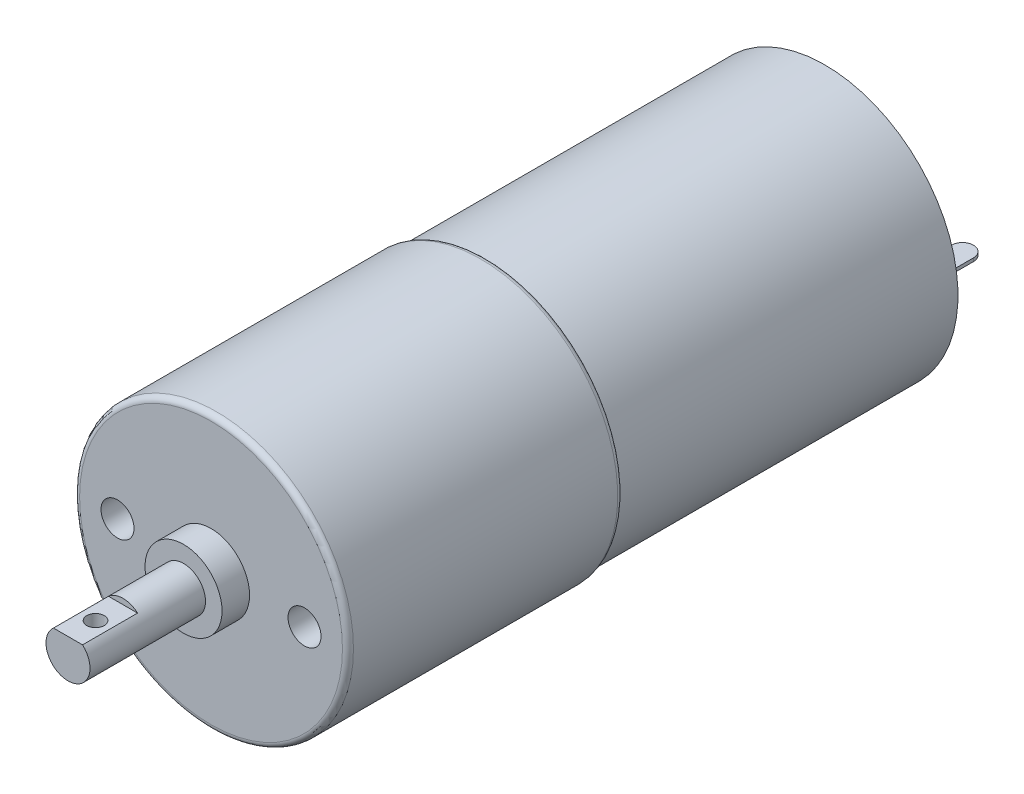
ISO-10303-21;
HEADER;
FILE_DESCRIPTION(('STEP AP214'),'2;1');
FILE_NAME('part.step','',(''),(''),'','','');
FILE_SCHEMA(('AUTOMOTIVE_DESIGN { 1 0 10303 214 1 1 1 1 }'));
ENDSEC;
DATA;
#1=APPLICATION_CONTEXT('core data for automotive mechanical design processes');
#2=APPLICATION_PROTOCOL_DEFINITION('international standard','automotive_design',2000,#1);
#3=PRODUCT_CONTEXT('',#1,'mechanical');
#4=PRODUCT('Part','Part','',(#3));
#5=PRODUCT_RELATED_PRODUCT_CATEGORY('part','',(#4));
#6=PRODUCT_DEFINITION_FORMATION('','',#4);
#7=PRODUCT_DEFINITION_CONTEXT('part definition',#1,'design');
#8=PRODUCT_DEFINITION('design','',#6,#7);
#9=PRODUCT_DEFINITION_SHAPE('','',#8);
#10=(LENGTH_UNIT() NAMED_UNIT(*) SI_UNIT(.MILLI.,.METRE.));
#11=(NAMED_UNIT(*) PLANE_ANGLE_UNIT() SI_UNIT($,.RADIAN.));
#12=(NAMED_UNIT(*) SI_UNIT($,.STERADIAN.) SOLID_ANGLE_UNIT());
#13=UNCERTAINTY_MEASURE_WITH_UNIT(LENGTH_MEASURE(1.E-05),#10,'distance_accuracy_value','');
#14=(GEOMETRIC_REPRESENTATION_CONTEXT(3) GLOBAL_UNCERTAINTY_ASSIGNED_CONTEXT((#13)) GLOBAL_UNIT_ASSIGNED_CONTEXT((#10,
#11,#12)) REPRESENTATION_CONTEXT('',''));
#15=CARTESIAN_POINT('',(0.,0.,0.));
#16=DIRECTION('',(0.,0.,1.));
#17=DIRECTION('',(1.,0.,0.));
#18=AXIS2_PLACEMENT_3D('',#15,#16,#17);
#19=CARTESIAN_POINT('',(0.,0.,68.799999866));
#20=DIRECTION('',(0.,0.,-1.));
#21=DIRECTION('',(-1.,0.,0.));
#22=AXIS2_PLACEMENT_3D('',#19,#20,#21);
#23=CYLINDRICAL_SURFACE('',#22,2.);
#24=CARTESIAN_POINT('',(0.,-2.,67.093749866));
#25=CARTESIAN_POINT('',(0.0426995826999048,-1.99999676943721,67.0937454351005));
#26=CARTESIAN_POINT('',(0.0854615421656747,-1.99861686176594,67.0902848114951));
#27=CARTESIAN_POINT('',(0.169778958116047,-1.99323137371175,67.0765616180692));
#28=CARTESIAN_POINT('',(0.211331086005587,-1.98921915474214,67.0662818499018));
#29=CARTESIAN_POINT('',(0.291877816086,-1.97900221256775,67.0393529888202));
#30=CARTESIAN_POINT('',(0.330880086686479,-1.97280445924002,67.0227241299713));
#31=CARTESIAN_POINT('',(0.405509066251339,-1.95882764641,66.9836494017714));
#32=CARTESIAN_POINT('',(0.441136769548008,-1.95104905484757,66.9612052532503));
#33=CARTESIAN_POINT('',(0.509709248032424,-1.93429443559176,66.9100345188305));
#34=CARTESIAN_POINT('',(0.542476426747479,-1.92528164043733,66.8810820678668));
#35=CARTESIAN_POINT('',(0.602839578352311,-1.90724379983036,66.8181935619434));
#36=CARTESIAN_POINT('',(0.630433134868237,-1.89821875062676,66.7842551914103));
#37=CARTESIAN_POINT('',(0.680852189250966,-1.88074039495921,66.7105577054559));
#38=CARTESIAN_POINT('',(0.703416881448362,-1.87232926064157,66.6706091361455));
#39=CARTESIAN_POINT('',(0.741427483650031,-1.8576070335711,66.5870995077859));
#40=CARTESIAN_POINT('',(0.756876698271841,-1.85129496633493,66.5435401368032));
#41=CARTESIAN_POINT('',(0.779501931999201,-1.8418799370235,66.4560860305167));
#42=CARTESIAN_POINT('',(0.787017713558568,-1.83864582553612,66.4122938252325));
#43=CARTESIAN_POINT('',(0.794624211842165,-1.83537224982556,66.3239596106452));
#44=CARTESIAN_POINT('',(0.794718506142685,-1.83533124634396,66.2794179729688));
#45=CARTESIAN_POINT('',(0.787737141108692,-1.83833648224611,66.19409359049));
#46=CARTESIAN_POINT('',(0.781150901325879,-1.84117198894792,66.1532619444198));
#47=CARTESIAN_POINT('',(0.761810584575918,-1.84925750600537,66.0733397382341));
#48=CARTESIAN_POINT('',(0.749055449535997,-1.85450793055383,66.0342494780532));
#49=CARTESIAN_POINT('',(0.717497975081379,-1.86694623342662,65.9579854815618));
#50=CARTESIAN_POINT('',(0.698578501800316,-1.87417116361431,65.9208665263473));
#51=CARTESIAN_POINT('',(0.655311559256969,-1.8897339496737,65.8501953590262));
#52=CARTESIAN_POINT('',(0.630962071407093,-1.89807221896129,65.8166444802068));
#53=CARTESIAN_POINT('',(0.575350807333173,-1.91569410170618,65.7513788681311));
#54=CARTESIAN_POINT('',(0.54370435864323,-1.92500140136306,65.7199974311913));
#55=CARTESIAN_POINT('',(0.475497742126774,-1.9429731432,65.6628813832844));
#56=CARTESIAN_POINT('',(0.43893662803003,-1.95163746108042,65.6371478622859));
#57=CARTESIAN_POINT('',(0.361005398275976,-1.9675580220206,65.5916299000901));
#58=CARTESIAN_POINT('',(0.319556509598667,-1.97478407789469,65.5719690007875));
#59=CARTESIAN_POINT('',(0.233580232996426,-1.98678628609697,65.540013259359));
#60=CARTESIAN_POINT('',(0.189054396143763,-1.99156366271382,65.527714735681));
#61=CARTESIAN_POINT('',(0.100983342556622,-1.99790811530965,65.5115026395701));
#62=CARTESIAN_POINT('',(0.0575328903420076,-1.99964648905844,65.5071410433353));
#63=CARTESIAN_POINT('',(-0.0295095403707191,-2.00025534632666,65.5056060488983));
#64=CARTESIAN_POINT('',(-0.0731014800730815,-1.99912655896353,65.5084308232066));
#65=CARTESIAN_POINT('',(-0.157170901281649,-1.99424018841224,65.5208574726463));
#66=CARTESIAN_POINT('',(-0.197700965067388,-1.9906006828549,65.5301551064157));
#67=CARTESIAN_POINT('',(-0.276589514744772,-1.98118084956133,65.5548512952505));
#68=CARTESIAN_POINT('',(-0.314947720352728,-1.97540024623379,65.5702506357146));
#69=CARTESIAN_POINT('',(-0.389717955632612,-1.96204151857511,65.6072146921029));
#70=CARTESIAN_POINT('',(-0.426035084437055,-1.95441399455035,65.6289529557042));
#71=CARTESIAN_POINT('',(-0.494633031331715,-1.93819056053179,65.6777848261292));
#72=CARTESIAN_POINT('',(-0.526912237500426,-1.92959426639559,65.7048805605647));
#73=CARTESIAN_POINT('',(-0.588718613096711,-1.91167791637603,65.7657248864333));
#74=CARTESIAN_POINT('',(-0.617930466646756,-1.90234713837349,65.7997914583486));
#75=CARTESIAN_POINT('',(-0.670298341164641,-1.88453370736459,65.8725106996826));
#76=CARTESIAN_POINT('',(-0.693453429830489,-1.87605118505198,65.9111640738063));
#77=CARTESIAN_POINT('',(-0.733179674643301,-1.86088848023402,65.9925064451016));
#78=CARTESIAN_POINT('',(-0.749690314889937,-1.85422503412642,66.0352283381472));
#79=CARTESIAN_POINT('',(-0.775157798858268,-1.84372550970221,66.1231895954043));
#80=CARTESIAN_POINT('',(-0.784120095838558,-1.83988739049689,66.1684271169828));
#81=CARTESIAN_POINT('',(-0.793719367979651,-1.83576532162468,66.2566743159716));
#82=CARTESIAN_POINT('',(-0.794902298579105,-1.83524835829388,66.2996141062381));
#83=CARTESIAN_POINT('',(-0.790338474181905,-1.83721834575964,66.3850493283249));
#84=CARTESIAN_POINT('',(-0.784592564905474,-1.8397049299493,66.4275448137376));
#85=CARTESIAN_POINT('',(-0.766777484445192,-1.84719774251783,66.5092185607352));
#86=CARTESIAN_POINT('',(-0.754959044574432,-1.852103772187,66.5484615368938));
#87=CARTESIAN_POINT('',(-0.725567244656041,-1.8638135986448,66.6244240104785));
#88=CARTESIAN_POINT('',(-0.70799236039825,-1.87061789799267,66.6611428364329));
#89=CARTESIAN_POINT('',(-0.666435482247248,-1.88583647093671,66.733280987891));
#90=CARTESIAN_POINT('',(-0.642146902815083,-1.89432011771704,66.7685088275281));
#91=CARTESIAN_POINT('',(-0.588301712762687,-1.91172720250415,66.8345624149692));
#92=CARTESIAN_POINT('',(-0.558743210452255,-1.92065079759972,66.8653865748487));
#93=CARTESIAN_POINT('',(-0.492962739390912,-1.93861322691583,66.9237633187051));
#94=CARTESIAN_POINT('',(-0.456436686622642,-1.94762334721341,66.9509835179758));
#95=CARTESIAN_POINT('',(-0.37900206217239,-1.9641591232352,66.9989044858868));
#96=CARTESIAN_POINT('',(-0.338092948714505,-1.97168459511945,67.0196044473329));
#97=CARTESIAN_POINT('',(-0.256675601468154,-1.98385121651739,67.0522722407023));
#98=CARTESIAN_POINT('',(-0.216435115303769,-1.98868467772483,67.0648376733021));
#99=CARTESIAN_POINT('',(-0.134330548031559,-1.99590608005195,67.0834255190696));
#100=CARTESIAN_POINT('',(-0.0924712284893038,-1.9983006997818,67.0894658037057));
#101=CARTESIAN_POINT('',(-0.0336390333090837,-1.99978881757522,67.0932167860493));
#102=CARTESIAN_POINT('',(-0.0168243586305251,-2.00000127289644,67.0937516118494));
#103=CARTESIAN_POINT('',(0.,-2.,67.093749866));
#104=B_SPLINE_CURVE_WITH_KNOTS('',3,(#24,#25,#26,#27,#28,#29,#30,#31,#32,#33,#34,#35,#36,#37,
#38,#39,#40,#41,#42,#43,#44,#45,#46,#47,#48,#49,#50,#51,#52,#53,#54,#55,#56,#57,#58,#59,#60,#61,
#62,#63,#64,#65,#66,#67,#68,#69,#70,#71,#72,#73,#74,#75,#76,#77,#78,#79,#80,#81,#82,#83,#84,#85,
#86,#87,#88,#89,#90,#91,#92,#93,#94,#95,#96,#97,#98,#99,#100,#101,#102,#103),.UNSPECIFIED.,.T.,
.F.,(4,2,2,2,2,2,2,2,2,2,2,2,2,2,2,2,2,2,2,2,2,2,2,2,2,2,2,2,2,2,2,2,2,2,2,2,2,2,2,4),(0.,
0.12804832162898,0.256420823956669,0.384387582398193,0.512316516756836,0.645664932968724,
0.779075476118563,0.9183113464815,1.05748248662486,1.19041612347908,1.32328567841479,
1.44707742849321,1.57089041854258,1.69720857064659,1.82357375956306,1.95954196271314,
2.09553638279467,2.23413862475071,2.37267150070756,2.50310832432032,2.63351198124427,
2.7581671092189,2.8828382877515,3.01130785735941,3.13982854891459,3.27670408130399,
3.41360067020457,3.55171729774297,3.68973405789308,3.81795091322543,3.94615212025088,
4.06944091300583,4.19276237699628,4.32307068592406,4.45342586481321,4.59206492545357,
4.73072114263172,4.85746004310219,4.98385093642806,5.03430414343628),.UNSPECIFIED.);
#105=CARTESIAN_POINT('',(0.,-2.,67.093749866));
#106=VERTEX_POINT('',#105);
#107=EDGE_CURVE('E77',#106,#106,#104,.T.);
#108=ORIENTED_EDGE('',*,*,#107,.T.);
#109=EDGE_LOOP('',(#108));
#110=FACE_BOUND('',#109,.T.);
#111=CARTESIAN_POINT('',(0.,0.,68.799999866));
#112=DIRECTION('',(0.,0.,1.));
#113=DIRECTION('',(1.,0.,0.));
#114=AXIS2_PLACEMENT_3D('',#111,#112,#113);
#115=CIRCLE('',#114,2.);
#116=CARTESIAN_POINT('',(-1.3228756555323,1.5,68.799999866));
#117=VERTEX_POINT('',#116);
#118=CARTESIAN_POINT('',(1.3228756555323,1.5,68.799999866));
#119=VERTEX_POINT('',#118);
#120=EDGE_CURVE('E12',#117,#119,#115,.T.);
#121=ORIENTED_EDGE('',*,*,#120,.F.);
#122=DIRECTION('',(0.,0.,1.));
#123=VECTOR('',#122,1.);
#124=CARTESIAN_POINT('',(-1.3228756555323,1.5,63.799999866));
#125=LINE('',#124,#123);
#126=CARTESIAN_POINT('',(-1.3228756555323,1.5,63.799999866));
#127=VERTEX_POINT('',#126);
#128=EDGE_CURVE('E61',#127,#117,#125,.T.);
#129=ORIENTED_EDGE('',*,*,#128,.F.);
#130=CARTESIAN_POINT('',(0.,0.,63.799999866));
#131=DIRECTION('',(0.,0.,1.));
#132=DIRECTION('',(1.,0.,0.));
#133=AXIS2_PLACEMENT_3D('',#130,#131,#132);
#134=CIRCLE('',#133,2.);
#135=CARTESIAN_POINT('',(1.3228756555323,1.5,63.799999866));
#136=VERTEX_POINT('',#135);
#137=EDGE_CURVE('E76',#136,#127,#134,.T.);
#138=ORIENTED_EDGE('',*,*,#137,.F.);
#139=DIRECTION('',(0.,0.,1.));
#140=VECTOR('',#139,1.);
#141=CARTESIAN_POINT('',(1.3228756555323,1.5,63.799999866));
#142=LINE('',#141,#140);
#143=EDGE_CURVE('E67',#136,#119,#142,.T.);
#144=ORIENTED_EDGE('',*,*,#143,.T.);
#145=EDGE_LOOP('',(#121,#129,#138,#144));
#146=FACE_BOUND('',#145,.T.);
#147=CARTESIAN_POINT('',(0.,0.,58.300000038));
#148=DIRECTION('',(0.,0.,1.));
#149=DIRECTION('',(1.,0.,0.));
#150=AXIS2_PLACEMENT_3D('',#147,#148,#149);
#151=CIRCLE('',#150,2.);
#152=CARTESIAN_POINT('',(2.,0.,58.300000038));
#153=VERTEX_POINT('',#152);
#154=EDGE_CURVE('E50',#153,#153,#151,.T.);
#155=ORIENTED_EDGE('',*,*,#154,.T.);
#156=EDGE_LOOP('',(#155));
#157=FACE_BOUND('',#156,.T.);
#158=ADVANCED_FACE('F46',(#110,#146,#157),#23,.T.);
#159=CARTESIAN_POINT('',(0.,0.,68.799999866));
#160=DIRECTION('',(0.,0.,1.));
#161=DIRECTION('',(1.,0.,0.));
#162=AXIS2_PLACEMENT_3D('',#159,#160,#161);
#163=PLANE('',#162);
#164=DIRECTION('',(1.,0.,0.));
#165=VECTOR('',#164,1.);
#166=CARTESIAN_POINT('',(-1.3228756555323,1.5,68.799999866));
#167=LINE('',#166,#165);
#168=EDGE_CURVE('E72',#117,#119,#167,.T.);
#169=ORIENTED_EDGE('',*,*,#168,.F.);
#170=ORIENTED_EDGE('',*,*,#120,.T.);
#171=EDGE_LOOP('',(#169,#170));
#172=FACE_BOUND('',#171,.T.);
#173=ADVANCED_FACE('F83',(#172),#163,.T.);
#174=CARTESIAN_POINT('',(0.,0.,58.300000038));
#175=DIRECTION('',(0.,0.,1.));
#176=DIRECTION('',(1.,0.,0.));
#177=AXIS2_PLACEMENT_3D('',#174,#175,#176);
#178=PLANE('',#177);
#179=ORIENTED_EDGE('',*,*,#154,.F.);
#180=EDGE_LOOP('',(#179));
#181=FACE_BOUND('',#180,.T.);
#182=ADVANCED_FACE('F85',(#181),#178,.F.);
#183=CARTESIAN_POINT('',(-1.3228756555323,1.5,63.799999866));
#184=DIRECTION('',(0.,-1.,0.));
#185=DIRECTION('',(0.,0.,-1.));
#186=AXIS2_PLACEMENT_3D('',#183,#184,#185);
#187=PLANE('',#186);
#188=CARTESIAN_POINT('',(0.,1.5,66.299999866));
#189=DIRECTION('',(0.,1.,0.));
#190=DIRECTION('',(0.,0.,1.));
#191=AXIS2_PLACEMENT_3D('',#188,#189,#190);
#192=CIRCLE('',#191,0.79375);
#193=CARTESIAN_POINT('',(0.,1.5,67.093749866));
#194=VERTEX_POINT('',#193);
#195=EDGE_CURVE('E112',#194,#194,#192,.T.);
#196=ORIENTED_EDGE('',*,*,#195,.F.);
#197=EDGE_LOOP('',(#196));
#198=FACE_BOUND('',#197,.T.);
#199=ORIENTED_EDGE('',*,*,#168,.T.);
#200=ORIENTED_EDGE('',*,*,#143,.F.);
#201=DIRECTION('',(1.,0.,0.));
#202=VECTOR('',#201,1.);
#203=CARTESIAN_POINT('',(-1.3228756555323,1.5,63.799999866));
#204=LINE('',#203,#202);
#205=EDGE_CURVE('E114',#127,#136,#204,.T.);
#206=ORIENTED_EDGE('',*,*,#205,.F.);
#207=ORIENTED_EDGE('',*,*,#128,.T.);
#208=EDGE_LOOP('',(#199,#200,#206,#207));
#209=FACE_BOUND('',#208,.T.);
#210=ADVANCED_FACE('F73',(#198,#209),#187,.F.);
#211=CARTESIAN_POINT('',(0.,0.,63.799999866));
#212=DIRECTION('',(0.,0.,1.));
#213=DIRECTION('',(1.,0.,0.));
#214=AXIS2_PLACEMENT_3D('',#211,#212,#213);
#215=PLANE('',#214);
#216=ORIENTED_EDGE('',*,*,#137,.T.);
#217=ORIENTED_EDGE('',*,*,#205,.T.);
#218=EDGE_LOOP('',(#216,#217));
#219=FACE_BOUND('',#218,.T.);
#220=ADVANCED_FACE('F96',(#219),#215,.T.);
#221=CARTESIAN_POINT('',(0.,-12.446,66.299999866));
#222=DIRECTION('',(0.,1.,0.));
#223=DIRECTION('',(0.,0.,1.));
#224=AXIS2_PLACEMENT_3D('',#221,#222,#223);
#225=CYLINDRICAL_SURFACE('',#224,0.79375);
#226=ORIENTED_EDGE('',*,*,#195,.T.);
#227=EDGE_LOOP('',(#226));
#228=FACE_BOUND('',#227,.T.);
#229=ORIENTED_EDGE('',*,*,#107,.F.);
#230=EDGE_LOOP('',(#229));
#231=FACE_BOUND('',#230,.T.);
#232=ADVANCED_FACE('F100',(#228,#231),#225,.F.);
#233=CLOSED_SHELL('',(#158,#173,#182,#210,#220,#232));
#234=MANIFOLD_SOLID_BREP('B2',#233);
#235=CARTESIAN_POINT('',(0.,0.,0.));
#236=DIRECTION('',(0.,0.,1.));
#237=DIRECTION('',(1.,0.,0.));
#238=AXIS2_PLACEMENT_3D('',#235,#236,#237);
#239=PLANE('',#238);
#240=DIRECTION('',(0.,1.,0.));
#241=VECTOR('',#240,1.);
#242=CARTESIAN_POINT('',(8.,0.15,0.));
#243=LINE('',#242,#241);
#244=CARTESIAN_POINT('',(8.,-0.15,0.));
#245=VERTEX_POINT('',#244);
#246=CARTESIAN_POINT('',(8.,0.15,0.));
#247=VERTEX_POINT('',#246);
#248=EDGE_CURVE('E267',#245,#247,#243,.T.);
#249=ORIENTED_EDGE('',*,*,#248,.F.);
#250=DIRECTION('',(-1.,0.,0.));
#251=VECTOR('',#250,1.);
#252=CARTESIAN_POINT('',(10.,-0.15,0.));
#253=LINE('',#252,#251);
#254=CARTESIAN_POINT('',(10.,-0.15,0.));
#255=VERTEX_POINT('',#254);
#256=EDGE_CURVE('E276',#255,#245,#253,.T.);
#257=ORIENTED_EDGE('',*,*,#256,.F.);
#258=DIRECTION('',(0.,-1.,0.));
#259=VECTOR('',#258,1.);
#260=CARTESIAN_POINT('',(10.,0.15,0.));
#261=LINE('',#260,#259);
#262=CARTESIAN_POINT('',(10.,0.15,0.));
#263=VERTEX_POINT('',#262);
#264=EDGE_CURVE('E273',#263,#255,#261,.T.);
#265=ORIENTED_EDGE('',*,*,#264,.F.);
#266=DIRECTION('',(1.,0.,0.));
#267=VECTOR('',#266,1.);
#268=CARTESIAN_POINT('',(10.,0.15,0.));
#269=LINE('',#268,#267);
#270=EDGE_CURVE('E270',#247,#263,#269,.T.);
#271=ORIENTED_EDGE('',*,*,#270,.F.);
#272=EDGE_LOOP('',(#249,#257,#265,#271));
#273=FACE_BOUND('',#272,.T.);
#274=CARTESIAN_POINT('',(0.,0.,0.));
#275=DIRECTION('',(0.,0.,-1.));
#276=DIRECTION('',(-1.,0.,0.));
#277=AXIS2_PLACEMENT_3D('',#274,#275,#276);
#278=CIRCLE('',#277,2.53759738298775);
#279=CARTESIAN_POINT('',(-2.53759738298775,0.,0.));
#280=VERTEX_POINT('',#279);
#281=EDGE_CURVE('E288',#280,#280,#278,.T.);
#282=ORIENTED_EDGE('',*,*,#281,.F.);
#283=EDGE_LOOP('',(#282));
#284=FACE_BOUND('',#283,.T.);
#285=CARTESIAN_POINT('',(0.,0.,0.));
#286=DIRECTION('',(0.,0.,1.));
#287=DIRECTION('',(1.,0.,0.));
#288=AXIS2_PLACEMENT_3D('',#285,#286,#287);
#289=CIRCLE('',#288,12.0904);
#290=CARTESIAN_POINT('',(-12.0904,0.,0.));
#291=VERTEX_POINT('',#290);
#292=EDGE_CURVE('E307',#291,#291,#289,.T.);
#293=ORIENTED_EDGE('',*,*,#292,.F.);
#294=EDGE_LOOP('',(#293));
#295=FACE_BOUND('',#294,.T.);
#296=DIRECTION('',(0.,1.,0.));
#297=VECTOR('',#296,1.);
#298=CARTESIAN_POINT('',(-10.,0.15,0.));
#299=LINE('',#298,#297);
#300=CARTESIAN_POINT('',(-10.,-0.15,0.));
#301=VERTEX_POINT('',#300);
#302=CARTESIAN_POINT('',(-10.,0.15,0.));
#303=VERTEX_POINT('',#302);
#304=EDGE_CURVE('E238',#301,#303,#299,.T.);
#305=ORIENTED_EDGE('',*,*,#304,.F.);
#306=DIRECTION('',(-1.,0.,0.));
#307=VECTOR('',#306,1.);
#308=CARTESIAN_POINT('',(-10.,-0.15,0.));
#309=LINE('',#308,#307);
#310=CARTESIAN_POINT('',(-8.,-0.15,0.));
#311=VERTEX_POINT('',#310);
#312=EDGE_CURVE('E244',#311,#301,#309,.T.);
#313=ORIENTED_EDGE('',*,*,#312,.F.);
#314=DIRECTION('',(0.,-1.,0.));
#315=VECTOR('',#314,1.);
#316=CARTESIAN_POINT('',(-8.,0.15,0.));
#317=LINE('',#316,#315);
#318=CARTESIAN_POINT('',(-8.,0.15,0.));
#319=VERTEX_POINT('',#318);
#320=EDGE_CURVE('E257',#319,#311,#317,.T.);
#321=ORIENTED_EDGE('',*,*,#320,.F.);
#322=DIRECTION('',(1.,0.,0.));
#323=VECTOR('',#322,1.);
#324=CARTESIAN_POINT('',(-10.,0.15,0.));
#325=LINE('',#324,#323);
#326=EDGE_CURVE('E252',#303,#319,#325,.T.);
#327=ORIENTED_EDGE('',*,*,#326,.F.);
#328=EDGE_LOOP('',(#305,#313,#321,#327));
#329=FACE_BOUND('',#328,.T.);
#330=ADVANCED_FACE('F158',(#273,#284,#295,#329),#239,.F.);
#331=CARTESIAN_POINT('',(0.,0.,30.8));
#332=DIRECTION('',(0.,0.,-1.));
#333=DIRECTION('',(-1.,0.,0.));
#334=AXIS2_PLACEMENT_3D('',#331,#332,#333);
#335=CYLINDRICAL_SURFACE('',#334,12.0904);
#336=CARTESIAN_POINT('',(0.,0.,30.8));
#337=DIRECTION('',(0.,0.,1.));
#338=DIRECTION('',(1.,0.,0.));
#339=AXIS2_PLACEMENT_3D('',#336,#337,#338);
#340=CIRCLE('',#339,12.0904);
#341=CARTESIAN_POINT('',(-12.0904,0.,30.8));
#342=VERTEX_POINT('',#341);
#343=EDGE_CURVE('E312',#342,#342,#340,.T.);
#344=CARTESIAN_POINT('',(-12.0904,0.,30.8));
#345=CARTESIAN_POINT('',(-12.0904,0.,30.4791666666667));
#346=CARTESIAN_POINT('',(-12.0904,0.,30.1583333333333));
#347=CARTESIAN_POINT('',(-12.0904,0.,29.5166666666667));
#348=CARTESIAN_POINT('',(-12.0904,0.,29.1958333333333));
#349=CARTESIAN_POINT('',(-12.0904,0.,28.5541666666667));
#350=CARTESIAN_POINT('',(-12.0904,0.,28.2333333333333));
#351=CARTESIAN_POINT('',(-12.0904,0.,27.5916666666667));
#352=CARTESIAN_POINT('',(-12.0904,0.,27.2708333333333));
#353=CARTESIAN_POINT('',(-12.0904,0.,26.6291666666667));
#354=CARTESIAN_POINT('',(-12.0904,0.,26.3083333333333));
#355=CARTESIAN_POINT('',(-12.0904,0.,25.6666666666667));
#356=CARTESIAN_POINT('',(-12.0904,0.,25.3458333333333));
#357=CARTESIAN_POINT('',(-12.0904,0.,24.7041666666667));
#358=CARTESIAN_POINT('',(-12.0904,0.,24.3833333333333));
#359=CARTESIAN_POINT('',(-12.0904,0.,23.7416666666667));
#360=CARTESIAN_POINT('',(-12.0904,0.,23.4208333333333));
#361=CARTESIAN_POINT('',(-12.0904,0.,22.7791666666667));
#362=CARTESIAN_POINT('',(-12.0904,0.,22.4583333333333));
#363=CARTESIAN_POINT('',(-12.0904,0.,21.8166666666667));
#364=CARTESIAN_POINT('',(-12.0904,0.,21.4958333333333));
#365=CARTESIAN_POINT('',(-12.0904,0.,20.8541666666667));
#366=CARTESIAN_POINT('',(-12.0904,0.,20.5333333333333));
#367=CARTESIAN_POINT('',(-12.0904,0.,19.8916666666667));
#368=CARTESIAN_POINT('',(-12.0904,0.,19.5708333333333));
#369=CARTESIAN_POINT('',(-12.0904,0.,18.9291666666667));
#370=CARTESIAN_POINT('',(-12.0904,0.,18.6083333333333));
#371=CARTESIAN_POINT('',(-12.0904,0.,17.9666666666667));
#372=CARTESIAN_POINT('',(-12.0904,0.,17.6458333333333));
#373=CARTESIAN_POINT('',(-12.0904,0.,17.0041666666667));
#374=CARTESIAN_POINT('',(-12.0904,0.,16.6833333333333));
#375=CARTESIAN_POINT('',(-12.0904,0.,16.0416666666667));
#376=CARTESIAN_POINT('',(-12.0904,0.,15.7208333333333));
#377=CARTESIAN_POINT('',(-12.0904,0.,15.0791666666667));
#378=CARTESIAN_POINT('',(-12.0904,0.,14.7583333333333));
#379=CARTESIAN_POINT('',(-12.0904,0.,14.1166666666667));
#380=CARTESIAN_POINT('',(-12.0904,0.,13.7958333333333));
#381=CARTESIAN_POINT('',(-12.0904,0.,13.1541666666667));
#382=CARTESIAN_POINT('',(-12.0904,0.,12.8333333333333));
#383=CARTESIAN_POINT('',(-12.0904,0.,12.1916666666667));
#384=CARTESIAN_POINT('',(-12.0904,0.,11.8708333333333));
#385=CARTESIAN_POINT('',(-12.0904,0.,11.2291666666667));
#386=CARTESIAN_POINT('',(-12.0904,0.,10.9083333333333));
#387=CARTESIAN_POINT('',(-12.0904,0.,10.2666666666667));
#388=CARTESIAN_POINT('',(-12.0904,0.,9.94583333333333));
#389=CARTESIAN_POINT('',(-12.0904,0.,9.30416666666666));
#390=CARTESIAN_POINT('',(-12.0904,0.,8.98333333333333));
#391=CARTESIAN_POINT('',(-12.0904,0.,8.34166666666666));
#392=CARTESIAN_POINT('',(-12.0904,0.,8.02083333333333));
#393=CARTESIAN_POINT('',(-12.0904,0.,7.37916666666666));
#394=CARTESIAN_POINT('',(-12.0904,0.,7.05833333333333));
#395=CARTESIAN_POINT('',(-12.0904,0.,6.41666666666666));
#396=CARTESIAN_POINT('',(-12.0904,0.,6.09583333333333));
#397=CARTESIAN_POINT('',(-12.0904,0.,5.45416666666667));
#398=CARTESIAN_POINT('',(-12.0904,0.,5.13333333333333));
#399=CARTESIAN_POINT('',(-12.0904,0.,4.49166666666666));
#400=CARTESIAN_POINT('',(-12.0904,0.,4.17083333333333));
#401=CARTESIAN_POINT('',(-12.0904,0.,3.52916666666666));
#402=CARTESIAN_POINT('',(-12.0904,0.,3.20833333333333));
#403=CARTESIAN_POINT('',(-12.0904,0.,2.56666666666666));
#404=CARTESIAN_POINT('',(-12.0904,0.,2.24583333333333));
#405=CARTESIAN_POINT('',(-12.0904,0.,1.60416666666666));
#406=CARTESIAN_POINT('',(-12.0904,0.,1.28333333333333));
#407=CARTESIAN_POINT('',(-12.0904,0.,0.641666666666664));
#408=CARTESIAN_POINT('',(-12.0904,0.,0.32083333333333));
#409=CARTESIAN_POINT('',(-12.0904,0.,0.));
#410=B_SPLINE_CURVE_WITH_KNOTS('',3,(#344,#345,#346,#347,#348,#349,#350,#351,#352,#353,#354,
#355,#356,#357,#358,#359,#360,#361,#362,#363,#364,#365,#366,#367,#368,#369,#370,#371,#372,#373,
#374,#375,#376,#377,#378,#379,#380,#381,#382,#383,#384,#385,#386,#387,#388,#389,#390,#391,#392,
#393,#394,#395,#396,#397,#398,#399,#400,#401,#402,#403,#404,#405,#406,#407,#408,#409),
.UNSPECIFIED.,.F.,.F.,(4,2,2,2,2,2,2,2,2,2,2,2,2,2,2,2,2,2,2,2,2,2,2,2,2,2,2,2,2,2,2,2,4),(0.,
0.962499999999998,1.925,2.8875,3.85,4.8125,5.775,6.7375,7.7,8.6625,9.625,10.5875,11.55,12.5125,
13.475,14.4375,15.4,16.3625,17.325,18.2875,19.25,20.2125,21.175,22.1375,23.1,24.0625,25.025,
25.9875,26.95,27.9125,28.875,29.8375,30.8),.UNSPECIFIED.);
#411=EDGE_CURVE('BSEAM365',#342,#291,#410,.T.);
#412=ORIENTED_EDGE('',*,*,#343,.F.);
#413=ORIENTED_EDGE('',*,*,#292,.T.);
#414=ORIENTED_EDGE('',*,*,#411,.T.);
#415=ORIENTED_EDGE('',*,*,#411,.F.);
#416=EDGE_LOOP('',(#412,#414,#413,#415));
#417=FACE_BOUND('',#416,.T.);
#418=ADVANCED_FACE('F365',(#417),#335,.T.);
#419=CARTESIAN_POINT('',(0.,0.,55.800000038));
#420=DIRECTION('',(0.,0.,-1.));
#421=DIRECTION('',(-1.,0.,0.));
#422=AXIS2_PLACEMENT_3D('',#419,#420,#421);
#423=CYLINDRICAL_SURFACE('',#422,12.446);
#424=CARTESIAN_POINT('',(0.,0.,31.2786947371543));
#425=DIRECTION('',(0.,0.,-1.));
#426=DIRECTION('',(-1.,0.,0.));
#427=AXIS2_PLACEMENT_3D('',#424,#425,#426);
#428=CIRCLE('',#427,12.446);
#429=CARTESIAN_POINT('',(-12.446,0.,31.2786947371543));
#430=VERTEX_POINT('',#429);
#431=EDGE_CURVE('E319',#430,#430,#428,.F.);
#432=ORIENTED_EDGE('',*,*,#431,.T.);
#433=EDGE_LOOP('',(#432));
#434=FACE_BOUND('',#433,.T.);
#435=CARTESIAN_POINT('',(0.,0.,55.300000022));
#436=DIRECTION('',(0.,0.,1.));
#437=DIRECTION('',(1.,0.,0.));
#438=AXIS2_PLACEMENT_3D('',#435,#436,#437);
#439=CIRCLE('',#438,12.446);
#440=CARTESIAN_POINT('',(12.446,0.,55.300000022));
#441=VERTEX_POINT('',#440);
#442=EDGE_CURVE('E311',#441,#441,#439,.F.);
#443=ORIENTED_EDGE('',*,*,#442,.T.);
#444=EDGE_LOOP('',(#443));
#445=FACE_BOUND('',#444,.T.);
#446=ADVANCED_FACE('F371',(#434,#445),#423,.T.);
#447=CARTESIAN_POINT('',(0.,0.,55.800000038));
#448=DIRECTION('',(0.,0.,1.));
#449=DIRECTION('',(1.,0.,0.));
#450=AXIS2_PLACEMENT_3D('',#447,#448,#449);
#451=PLANE('',#450);
#452=CARTESIAN_POINT('',(8.5,0.,55.800000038));
#453=DIRECTION('',(0.,0.,1.));
#454=DIRECTION('',(1.,0.,0.));
#455=AXIS2_PLACEMENT_3D('',#452,#453,#454);
#456=CIRCLE('',#455,1.5);
#457=CARTESIAN_POINT('',(10.,0.,55.800000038));
#458=VERTEX_POINT('',#457);
#459=EDGE_CURVE('E297',#458,#458,#456,.T.);
#460=ORIENTED_EDGE('',*,*,#459,.F.);
#461=EDGE_LOOP('',(#460));
#462=FACE_BOUND('',#461,.T.);
#463=CARTESIAN_POINT('',(-8.5,0.,55.800000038));
#464=DIRECTION('',(0.,0.,1.));
#465=DIRECTION('',(1.,0.,0.));
#466=AXIS2_PLACEMENT_3D('',#463,#464,#465);
#467=CIRCLE('',#466,1.5);
#468=CARTESIAN_POINT('',(-7.,0.,55.800000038));
#469=VERTEX_POINT('',#468);
#470=EDGE_CURVE('E287',#469,#469,#467,.T.);
#471=ORIENTED_EDGE('',*,*,#470,.F.);
#472=EDGE_LOOP('',(#471));
#473=FACE_BOUND('',#472,.T.);
#474=CARTESIAN_POINT('',(0.,0.,55.800000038));
#475=DIRECTION('',(0.,0.,1.));
#476=DIRECTION('',(1.,0.,0.));
#477=AXIS2_PLACEMENT_3D('',#474,#475,#476);
#478=CIRCLE('',#477,11.945999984);
#479=CARTESIAN_POINT('',(11.945999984,0.,55.800000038));
#480=VERTEX_POINT('',#479);
#481=EDGE_CURVE('E292',#480,#480,#478,.T.);
#482=ORIENTED_EDGE('',*,*,#481,.T.);
#483=EDGE_LOOP('',(#482));
#484=FACE_BOUND('',#483,.T.);
#485=CARTESIAN_POINT('',(0.,0.,55.800000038));
#486=DIRECTION('',(0.,0.,1.));
#487=DIRECTION('',(1.,0.,0.));
#488=AXIS2_PLACEMENT_3D('',#485,#486,#487);
#489=CIRCLE('',#488,3.5);
#490=CARTESIAN_POINT('',(3.5,0.,55.800000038));
#491=VERTEX_POINT('',#490);
#492=EDGE_CURVE('E308',#491,#491,#489,.T.);
#493=ORIENTED_EDGE('',*,*,#492,.F.);
#494=EDGE_LOOP('',(#493));
#495=FACE_BOUND('',#494,.T.);
#496=ADVANCED_FACE('F452',(#462,#473,#484,#495),#451,.T.);
#497=CARTESIAN_POINT('',(0.,0.,58.300000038));
#498=DIRECTION('',(0.,0.,-1.));
#499=DIRECTION('',(-1.,0.,0.));
#500=AXIS2_PLACEMENT_3D('',#497,#498,#499);
#501=CYLINDRICAL_SURFACE('',#500,3.5);
#502=CARTESIAN_POINT('',(0.,0.,58.300000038));
#503=DIRECTION('',(0.,0.,1.));
#504=DIRECTION('',(1.,0.,0.));
#505=AXIS2_PLACEMENT_3D('',#502,#503,#504);
#506=CIRCLE('',#505,3.5);
#507=CARTESIAN_POINT('',(3.5,0.,58.300000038));
#508=VERTEX_POINT('',#507);
#509=EDGE_CURVE('E296',#508,#508,#506,.T.);
#510=ORIENTED_EDGE('',*,*,#509,.F.);
#511=EDGE_LOOP('',(#510));
#512=FACE_BOUND('',#511,.T.);
#513=ORIENTED_EDGE('',*,*,#492,.T.);
#514=EDGE_LOOP('',(#513));
#515=FACE_BOUND('',#514,.T.);
#516=ADVANCED_FACE('F449',(#512,#515),#501,.T.);
#517=CARTESIAN_POINT('',(0.,0.,58.300000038));
#518=DIRECTION('',(0.,0.,1.));
#519=DIRECTION('',(1.,0.,0.));
#520=AXIS2_PLACEMENT_3D('',#517,#518,#519);
#521=PLANE('',#520);
#522=ORIENTED_EDGE('',*,*,#509,.T.);
#523=EDGE_LOOP('',(#522));
#524=FACE_BOUND('',#523,.T.);
#525=ADVANCED_FACE('F383',(#524),#521,.T.);
#526=CARTESIAN_POINT('',(0.,0.,31.2786947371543));
#527=DIRECTION('',(0.,0.,-1.));
#528=DIRECTION('',(-1.,0.,0.));
#529=AXIS2_PLACEMENT_3D('',#526,#527,#528);
#530=TOROIDAL_SURFACE('',#529,11.945999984,0.500000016);
#531=ORIENTED_EDGE('',*,*,#343,.T.);
#532=EDGE_LOOP('',(#531));
#533=FACE_BOUND('',#532,.T.);
#534=ORIENTED_EDGE('',*,*,#431,.F.);
#535=EDGE_LOOP('',(#534));
#536=FACE_BOUND('',#535,.T.);
#537=ADVANCED_FACE('F379',(#533,#536),#530,.T.);
#538=CARTESIAN_POINT('',(0.,0.,55.300000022));
#539=DIRECTION('',(0.,0.,1.));
#540=DIRECTION('',(1.,0.,0.));
#541=AXIS2_PLACEMENT_3D('',#538,#539,#540);
#542=TOROIDAL_SURFACE('',#541,11.945999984,0.500000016);
#543=ORIENTED_EDGE('',*,*,#442,.F.);
#544=EDGE_LOOP('',(#543));
#545=FACE_BOUND('',#544,.T.);
#546=ORIENTED_EDGE('',*,*,#481,.F.);
#547=EDGE_LOOP('',(#546));
#548=FACE_BOUND('',#547,.T.);
#549=ADVANCED_FACE('F382',(#545,#548),#542,.T.);
#550=CARTESIAN_POINT('',(-8.5,0.,52.300000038));
#551=DIRECTION('',(0.,0.,1.));
#552=DIRECTION('',(1.,0.,0.));
#553=AXIS2_PLACEMENT_3D('',#550,#551,#552);
#554=CYLINDRICAL_SURFACE('',#553,1.5);
#555=CARTESIAN_POINT('',(-8.5,0.,52.300000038));
#556=DIRECTION('',(0.,0.,1.));
#557=DIRECTION('',(1.,0.,0.));
#558=AXIS2_PLACEMENT_3D('',#555,#556,#557);
#559=CIRCLE('',#558,1.5);
#560=CARTESIAN_POINT('',(-7.,0.,52.300000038));
#561=VERTEX_POINT('',#560);
#562=EDGE_CURVE('E300',#561,#561,#559,.T.);
#563=ORIENTED_EDGE('',*,*,#562,.F.);
#564=EDGE_LOOP('',(#563));
#565=FACE_BOUND('',#564,.T.);
#566=ORIENTED_EDGE('',*,*,#470,.T.);
#567=EDGE_LOOP('',(#566));
#568=FACE_BOUND('',#567,.T.);
#569=ADVANCED_FACE('F387',(#565,#568),#554,.F.);
#570=CARTESIAN_POINT('',(-8.5,0.,52.300000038));
#571=DIRECTION('',(0.,0.,1.));
#572=DIRECTION('',(1.,0.,0.));
#573=AXIS2_PLACEMENT_3D('',#570,#571,#572);
#574=PLANE('',#573);
#575=ORIENTED_EDGE('',*,*,#562,.T.);
#576=EDGE_LOOP('',(#575));
#577=FACE_BOUND('',#576,.T.);
#578=ADVANCED_FACE('F439',(#577),#574,.T.);
#579=CARTESIAN_POINT('',(8.5,0.,52.300000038));
#580=DIRECTION('',(0.,0.,1.));
#581=DIRECTION('',(1.,0.,0.));
#582=AXIS2_PLACEMENT_3D('',#579,#580,#581);
#583=CYLINDRICAL_SURFACE('',#582,1.5);
#584=CARTESIAN_POINT('',(8.5,0.,52.300000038));
#585=DIRECTION('',(0.,0.,1.));
#586=DIRECTION('',(1.,0.,0.));
#587=AXIS2_PLACEMENT_3D('',#584,#585,#586);
#588=CIRCLE('',#587,1.5);
#589=CARTESIAN_POINT('',(10.,0.,52.300000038));
#590=VERTEX_POINT('',#589);
#591=EDGE_CURVE('E293',#590,#590,#588,.T.);
#592=ORIENTED_EDGE('',*,*,#591,.F.);
#593=EDGE_LOOP('',(#592));
#594=FACE_BOUND('',#593,.T.);
#595=ORIENTED_EDGE('',*,*,#459,.T.);
#596=EDGE_LOOP('',(#595));
#597=FACE_BOUND('',#596,.T.);
#598=ADVANCED_FACE('F435',(#594,#597),#583,.F.);
#599=CARTESIAN_POINT('',(8.5,0.,52.300000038));
#600=DIRECTION('',(0.,0.,1.));
#601=DIRECTION('',(1.,0.,0.));
#602=AXIS2_PLACEMENT_3D('',#599,#600,#601);
#603=PLANE('',#602);
#604=ORIENTED_EDGE('',*,*,#591,.T.);
#605=EDGE_LOOP('',(#604));
#606=FACE_BOUND('',#605,.T.);
#607=ADVANCED_FACE('F431',(#606),#603,.T.);
#608=CARTESIAN_POINT('',(0.,0.,-2.));
#609=DIRECTION('',(0.,0.,1.));
#610=DIRECTION('',(1.,0.,0.));
#611=AXIS2_PLACEMENT_3D('',#608,#609,#610);
#612=CYLINDRICAL_SURFACE('',#611,2.53759738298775);
#613=CARTESIAN_POINT('',(0.,0.,-1.499999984));
#614=DIRECTION('',(0.,0.,-1.));
#615=DIRECTION('',(-1.,0.,0.));
#616=AXIS2_PLACEMENT_3D('',#613,#614,#615);
#617=CIRCLE('',#616,2.53759738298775);
#618=CARTESIAN_POINT('',(-2.53759738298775,0.,-1.499999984));
#619=VERTEX_POINT('',#618);
#620=EDGE_CURVE('E44',#619,#619,#617,.F.);
#621=ORIENTED_EDGE('',*,*,#620,.T.);
#622=EDGE_LOOP('',(#621));
#623=FACE_BOUND('',#622,.T.);
#624=ORIENTED_EDGE('',*,*,#281,.T.);
#625=EDGE_LOOP('',(#624));
#626=FACE_BOUND('',#625,.T.);
#627=ADVANCED_FACE('F428',(#623,#626),#612,.T.);
#628=CARTESIAN_POINT('',(0.,0.,-2.));
#629=DIRECTION('',(0.,0.,-1.));
#630=DIRECTION('',(-1.,0.,0.));
#631=AXIS2_PLACEMENT_3D('',#628,#629,#630);
#632=PLANE('',#631);
#633=CARTESIAN_POINT('',(0.,0.,-2.));
#634=DIRECTION('',(0.,0.,-1.));
#635=DIRECTION('',(-1.,0.,0.));
#636=AXIS2_PLACEMENT_3D('',#633,#634,#635);
#637=CIRCLE('',#636,2.03759736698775);
#638=CARTESIAN_POINT('',(-2.03759736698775,0.,-2.));
#639=VERTEX_POINT('',#638);
#640=EDGE_CURVE('E166',#639,#639,#637,.T.);
#641=ORIENTED_EDGE('',*,*,#640,.T.);
#642=EDGE_LOOP('',(#641));
#643=FACE_BOUND('',#642,.T.);
#644=ADVANCED_FACE('F352',(#643),#632,.T.);
#645=CARTESIAN_POINT('',(8.,0.15,-4.5));
#646=DIRECTION('',(1.,0.,0.));
#647=DIRECTION('',(0.,0.,-1.));
#648=AXIS2_PLACEMENT_3D('',#645,#646,#647);
#649=PLANE('',#648);
#650=DIRECTION('',(0.,0.,1.));
#651=VECTOR('',#650,1.);
#652=CARTESIAN_POINT('',(8.,0.15,-4.5));
#653=LINE('',#652,#651);
#654=CARTESIAN_POINT('',(8.,0.15,-3.5));
#655=VERTEX_POINT('',#654);
#656=EDGE_CURVE('E285',#655,#247,#653,.T.);
#657=ORIENTED_EDGE('',*,*,#656,.F.);
#658=DIRECTION('',(0.,1.,0.));
#659=VECTOR('',#658,1.);
#660=CARTESIAN_POINT('',(8.,-0.15,-3.5));
#661=LINE('',#660,#659);
#662=CARTESIAN_POINT('',(8.,-0.15,-3.5));
#663=VERTEX_POINT('',#662);
#664=EDGE_CURVE('E343',#655,#663,#661,.F.);
#665=ORIENTED_EDGE('',*,*,#664,.T.);
#666=DIRECTION('',(0.,0.,1.));
#667=VECTOR('',#666,1.);
#668=CARTESIAN_POINT('',(8.,-0.15,-4.5));
#669=LINE('',#668,#667);
#670=EDGE_CURVE('E279',#663,#245,#669,.T.);
#671=ORIENTED_EDGE('',*,*,#670,.T.);
#672=ORIENTED_EDGE('',*,*,#248,.T.);
#673=EDGE_LOOP('',(#657,#665,#671,#672));
#674=FACE_BOUND('',#673,.T.);
#675=ADVANCED_FACE('F405',(#674),#649,.F.);
#676=CARTESIAN_POINT('',(10.,0.15,-4.5));
#677=DIRECTION('',(0.,-1.,0.));
#678=DIRECTION('',(1.,0.,0.));
#679=AXIS2_PLACEMENT_3D('',#676,#677,#678);
#680=PLANE('',#679);
#681=DIRECTION('',(0.,0.,1.));
#682=VECTOR('',#681,1.);
#683=CARTESIAN_POINT('',(10.,0.15,-4.5));
#684=LINE('',#683,#682);
#685=CARTESIAN_POINT('',(10.,0.15,-3.5));
#686=VERTEX_POINT('',#685);
#687=EDGE_CURVE('E283',#686,#263,#684,.T.);
#688=ORIENTED_EDGE('',*,*,#687,.F.);
#689=CARTESIAN_POINT('',(9.,0.15,-3.5));
#690=DIRECTION('',(0.,-1.,0.));
#691=DIRECTION('',(1.,0.,0.));
#692=AXIS2_PLACEMENT_3D('',#689,#690,#691);
#693=CIRCLE('',#692,1.);
#694=CARTESIAN_POINT('',(9.,0.15,-4.5));
#695=VERTEX_POINT('',#694);
#696=EDGE_CURVE('E178',#686,#695,#693,.F.);
#697=ORIENTED_EDGE('',*,*,#696,.T.);
#698=CARTESIAN_POINT('',(9.,0.15,-3.5));
#699=DIRECTION('',(0.,-1.,0.));
#700=DIRECTION('',(1.,0.,0.));
#701=AXIS2_PLACEMENT_3D('',#698,#699,#700);
#702=CIRCLE('',#701,1.);
#703=EDGE_CURVE('E173',#695,#655,#702,.F.);
#704=ORIENTED_EDGE('',*,*,#703,.T.);
#705=ORIENTED_EDGE('',*,*,#656,.T.);
#706=ORIENTED_EDGE('',*,*,#270,.T.);
#707=EDGE_LOOP('',(#688,#697,#704,#705,#706));
#708=FACE_BOUND('',#707,.T.);
#709=ADVANCED_FACE('F415',(#708),#680,.F.);
#710=CARTESIAN_POINT('',(10.,0.15,-4.5));
#711=DIRECTION('',(-1.,0.,0.));
#712=DIRECTION('',(0.,0.,1.));
#713=AXIS2_PLACEMENT_3D('',#710,#711,#712);
#714=PLANE('',#713);
#715=DIRECTION('',(0.,0.,1.));
#716=VECTOR('',#715,1.);
#717=CARTESIAN_POINT('',(10.,-0.15,-4.5));
#718=LINE('',#717,#716);
#719=CARTESIAN_POINT('',(10.,-0.15,-3.5));
#720=VERTEX_POINT('',#719);
#721=EDGE_CURVE('E281',#720,#255,#718,.T.);
#722=ORIENTED_EDGE('',*,*,#721,.F.);
#723=DIRECTION('',(0.,-1.,0.));
#724=VECTOR('',#723,1.);
#725=CARTESIAN_POINT('',(10.,0.15,-3.5));
#726=LINE('',#725,#724);
#727=EDGE_CURVE('E338',#720,#686,#726,.F.);
#728=ORIENTED_EDGE('',*,*,#727,.T.);
#729=ORIENTED_EDGE('',*,*,#687,.T.);
#730=ORIENTED_EDGE('',*,*,#264,.T.);
#731=EDGE_LOOP('',(#722,#728,#729,#730));
#732=FACE_BOUND('',#731,.T.);
#733=ADVANCED_FACE('F413',(#732),#714,.F.);
#734=CARTESIAN_POINT('',(10.,-0.15,-4.5));
#735=DIRECTION('',(0.,1.,0.));
#736=DIRECTION('',(0.,0.,1.));
#737=AXIS2_PLACEMENT_3D('',#734,#735,#736);
#738=PLANE('',#737);
#739=CARTESIAN_POINT('',(9.,-0.15,-3.5));
#740=DIRECTION('',(0.,1.,0.));
#741=DIRECTION('',(0.,0.,1.));
#742=AXIS2_PLACEMENT_3D('',#739,#740,#741);
#743=CIRCLE('',#742,1.);
#744=CARTESIAN_POINT('',(9.,-0.15,-4.5));
#745=VERTEX_POINT('',#744);
#746=EDGE_CURVE('E334',#663,#745,#743,.F.);
#747=ORIENTED_EDGE('',*,*,#746,.T.);
#748=CARTESIAN_POINT('',(9.,-0.15,-3.5));
#749=DIRECTION('',(0.,1.,0.));
#750=DIRECTION('',(0.,0.,1.));
#751=AXIS2_PLACEMENT_3D('',#748,#749,#750);
#752=CIRCLE('',#751,1.);
#753=EDGE_CURVE('E336',#745,#720,#752,.F.);
#754=ORIENTED_EDGE('',*,*,#753,.T.);
#755=ORIENTED_EDGE('',*,*,#721,.T.);
#756=ORIENTED_EDGE('',*,*,#256,.T.);
#757=ORIENTED_EDGE('',*,*,#670,.F.);
#758=EDGE_LOOP('',(#747,#754,#755,#756,#757));
#759=FACE_BOUND('',#758,.T.);
#760=ADVANCED_FACE('F407',(#759),#738,.F.);
#761=CARTESIAN_POINT('',(-10.,0.15,-4.5));
#762=DIRECTION('',(1.,0.,0.));
#763=DIRECTION('',(0.,0.,-1.));
#764=AXIS2_PLACEMENT_3D('',#761,#762,#763);
#765=PLANE('',#764);
#766=DIRECTION('',(0.,0.,1.));
#767=VECTOR('',#766,1.);
#768=CARTESIAN_POINT('',(-10.,0.15,-4.5));
#769=LINE('',#768,#767);
#770=CARTESIAN_POINT('',(-10.,0.15,-3.5));
#771=VERTEX_POINT('',#770);
#772=EDGE_CURVE('E265',#771,#303,#769,.T.);
#773=ORIENTED_EDGE('',*,*,#772,.F.);
#774=DIRECTION('',(0.,1.,0.));
#775=VECTOR('',#774,1.);
#776=CARTESIAN_POINT('',(-10.,0.15,-3.5));
#777=LINE('',#776,#775);
#778=CARTESIAN_POINT('',(-10.,-0.15,-3.5));
#779=VERTEX_POINT('',#778);
#780=EDGE_CURVE('E240',#771,#779,#777,.F.);
#781=ORIENTED_EDGE('',*,*,#780,.T.);
#782=DIRECTION('',(0.,0.,1.));
#783=VECTOR('',#782,1.);
#784=CARTESIAN_POINT('',(-10.,-0.15,-4.5));
#785=LINE('',#784,#783);
#786=EDGE_CURVE('E234',#779,#301,#785,.T.);
#787=ORIENTED_EDGE('',*,*,#786,.T.);
#788=ORIENTED_EDGE('',*,*,#304,.T.);
#789=EDGE_LOOP('',(#773,#781,#787,#788));
#790=FACE_BOUND('',#789,.T.);
#791=ADVANCED_FACE('F237',(#790),#765,.F.);
#792=CARTESIAN_POINT('',(-10.,0.15,-4.5));
#793=DIRECTION('',(0.,-1.,0.));
#794=DIRECTION('',(1.,0.,0.));
#795=AXIS2_PLACEMENT_3D('',#792,#793,#794);
#796=PLANE('',#795);
#797=CARTESIAN_POINT('',(-9.,0.15,-3.5));
#798=DIRECTION('',(0.,-1.,0.));
#799=DIRECTION('',(1.,0.,0.));
#800=AXIS2_PLACEMENT_3D('',#797,#798,#799);
#801=CIRCLE('',#800,1.);
#802=CARTESIAN_POINT('',(-8.,0.15,-3.5));
#803=VERTEX_POINT('',#802);
#804=CARTESIAN_POINT('',(-9.,0.15,-4.5));
#805=VERTEX_POINT('',#804);
#806=EDGE_CURVE('E291',#803,#805,#801,.F.);
#807=ORIENTED_EDGE('',*,*,#806,.T.);
#808=CARTESIAN_POINT('',(-9.,0.15,-3.5));
#809=DIRECTION('',(0.,-1.,0.));
#810=DIRECTION('',(1.,0.,0.));
#811=AXIS2_PLACEMENT_3D('',#808,#809,#810);
#812=CIRCLE('',#811,1.);
#813=EDGE_CURVE('E325',#805,#771,#812,.F.);
#814=ORIENTED_EDGE('',*,*,#813,.T.);
#815=ORIENTED_EDGE('',*,*,#772,.T.);
#816=ORIENTED_EDGE('',*,*,#326,.T.);
#817=DIRECTION('',(0.,0.,1.));
#818=VECTOR('',#817,1.);
#819=CARTESIAN_POINT('',(-8.,0.15,-4.5));
#820=LINE('',#819,#818);
#821=EDGE_CURVE('E263',#803,#319,#820,.T.);
#822=ORIENTED_EDGE('',*,*,#821,.F.);
#823=EDGE_LOOP('',(#807,#814,#815,#816,#822));
#824=FACE_BOUND('',#823,.T.);
#825=ADVANCED_FACE('F561',(#824),#796,.F.);
#826=CARTESIAN_POINT('',(-8.,0.15,-4.5));
#827=DIRECTION('',(-1.,0.,0.));
#828=DIRECTION('',(0.,0.,1.));
#829=AXIS2_PLACEMENT_3D('',#826,#827,#828);
#830=PLANE('',#829);
#831=DIRECTION('',(0.,0.,1.));
#832=VECTOR('',#831,1.);
#833=CARTESIAN_POINT('',(-8.,-0.15,-4.5));
#834=LINE('',#833,#832);
#835=CARTESIAN_POINT('',(-8.,-0.15,-3.5));
#836=VERTEX_POINT('',#835);
#837=EDGE_CURVE('E243',#836,#311,#834,.T.);
#838=ORIENTED_EDGE('',*,*,#837,.F.);
#839=DIRECTION('',(0.,-1.,0.));
#840=VECTOR('',#839,1.);
#841=CARTESIAN_POINT('',(-8.,0.15,-3.5));
#842=LINE('',#841,#840);
#843=EDGE_CURVE('E332',#836,#803,#842,.F.);
#844=ORIENTED_EDGE('',*,*,#843,.T.);
#845=ORIENTED_EDGE('',*,*,#821,.T.);
#846=ORIENTED_EDGE('',*,*,#320,.T.);
#847=EDGE_LOOP('',(#838,#844,#845,#846));
#848=FACE_BOUND('',#847,.T.);
#849=ADVANCED_FACE('F570',(#848),#830,.F.);
#850=CARTESIAN_POINT('',(-10.,-0.15,-4.5));
#851=DIRECTION('',(0.,1.,0.));
#852=DIRECTION('',(0.,0.,1.));
#853=AXIS2_PLACEMENT_3D('',#850,#851,#852);
#854=PLANE('',#853);
#855=ORIENTED_EDGE('',*,*,#786,.F.);
#856=CARTESIAN_POINT('',(-9.,-0.15,-3.5));
#857=DIRECTION('',(0.,1.,0.));
#858=DIRECTION('',(0.,0.,1.));
#859=AXIS2_PLACEMENT_3D('',#856,#857,#858);
#860=CIRCLE('',#859,1.);
#861=CARTESIAN_POINT('',(-9.,-0.15,-4.5));
#862=VERTEX_POINT('',#861);
#863=EDGE_CURVE('E330',#779,#862,#860,.F.);
#864=ORIENTED_EDGE('',*,*,#863,.T.);
#865=CARTESIAN_POINT('',(-9.,-0.15,-3.5));
#866=DIRECTION('',(0.,1.,0.));
#867=DIRECTION('',(0.,0.,1.));
#868=AXIS2_PLACEMENT_3D('',#865,#866,#867);
#869=CIRCLE('',#868,1.);
#870=EDGE_CURVE('E328',#862,#836,#869,.F.);
#871=ORIENTED_EDGE('',*,*,#870,.T.);
#872=ORIENTED_EDGE('',*,*,#837,.T.);
#873=ORIENTED_EDGE('',*,*,#312,.T.);
#874=EDGE_LOOP('',(#855,#864,#871,#872,#873));
#875=FACE_BOUND('',#874,.T.);
#876=ADVANCED_FACE('F255',(#875),#854,.F.);
#877=CARTESIAN_POINT('',(-9.,0.,-3.5));
#878=DIRECTION('',(0.,-1.,0.));
#879=DIRECTION('',(0.,0.,-1.));
#880=AXIS2_PLACEMENT_3D('',#877,#878,#879);
#881=CYLINDRICAL_SURFACE('',#880,1.);
#882=ORIENTED_EDGE('',*,*,#843,.F.);
#883=ORIENTED_EDGE('',*,*,#870,.F.);
#884=DIRECTION('',(0.,-1.,0.));
#885=VECTOR('',#884,1.);
#886=CARTESIAN_POINT('',(-9.,0.,-4.5));
#887=LINE('',#886,#885);
#888=EDGE_CURVE('E253',#805,#862,#887,.T.);
#889=ORIENTED_EDGE('',*,*,#888,.F.);
#890=ORIENTED_EDGE('',*,*,#806,.F.);
#891=EDGE_LOOP('',(#882,#883,#889,#890));
#892=FACE_BOUND('',#891,.T.);
#893=ADVANCED_FACE('F392',(#892),#881,.T.);
#894=CARTESIAN_POINT('',(-9.,0.,-3.5));
#895=DIRECTION('',(0.,1.,0.));
#896=DIRECTION('',(0.,0.,1.));
#897=AXIS2_PLACEMENT_3D('',#894,#895,#896);
#898=CYLINDRICAL_SURFACE('',#897,1.);
#899=ORIENTED_EDGE('',*,*,#863,.F.);
#900=ORIENTED_EDGE('',*,*,#780,.F.);
#901=ORIENTED_EDGE('',*,*,#813,.F.);
#902=ORIENTED_EDGE('',*,*,#888,.T.);
#903=EDGE_LOOP('',(#899,#900,#901,#902));
#904=FACE_BOUND('',#903,.T.);
#905=ADVANCED_FACE('F389',(#904),#898,.T.);
#906=CARTESIAN_POINT('',(9.,0.,-3.5));
#907=DIRECTION('',(0.,-1.,0.));
#908=DIRECTION('',(0.,0.,-1.));
#909=AXIS2_PLACEMENT_3D('',#906,#907,#908);
#910=CYLINDRICAL_SURFACE('',#909,1.);
#911=ORIENTED_EDGE('',*,*,#664,.F.);
#912=ORIENTED_EDGE('',*,*,#703,.F.);
#913=DIRECTION('',(0.,1.,0.));
#914=VECTOR('',#913,1.);
#915=CARTESIAN_POINT('',(9.,0.15,-4.5));
#916=LINE('',#915,#914);
#917=EDGE_CURVE('E347',#745,#695,#916,.T.);
#918=ORIENTED_EDGE('',*,*,#917,.F.);
#919=ORIENTED_EDGE('',*,*,#746,.F.);
#920=EDGE_LOOP('',(#911,#912,#918,#919));
#921=FACE_BOUND('',#920,.T.);
#922=ADVANCED_FACE('F360',(#921),#910,.T.);
#923=CARTESIAN_POINT('',(9.,0.,-3.5));
#924=DIRECTION('',(0.,1.,0.));
#925=DIRECTION('',(0.,0.,1.));
#926=AXIS2_PLACEMENT_3D('',#923,#924,#925);
#927=CYLINDRICAL_SURFACE('',#926,1.);
#928=ORIENTED_EDGE('',*,*,#696,.F.);
#929=ORIENTED_EDGE('',*,*,#727,.F.);
#930=ORIENTED_EDGE('',*,*,#753,.F.);
#931=ORIENTED_EDGE('',*,*,#917,.T.);
#932=EDGE_LOOP('',(#928,#929,#930,#931));
#933=FACE_BOUND('',#932,.T.);
#934=ADVANCED_FACE('F355',(#933),#927,.T.);
#935=CARTESIAN_POINT('',(0.,0.,-1.499999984));
#936=DIRECTION('',(0.,0.,-1.));
#937=DIRECTION('',(-1.,0.,0.));
#938=AXIS2_PLACEMENT_3D('',#935,#936,#937);
#939=TOROIDAL_SURFACE('',#938,2.03759736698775,0.500000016);
#940=ORIENTED_EDGE('',*,*,#620,.F.);
#941=EDGE_LOOP('',(#940));
#942=FACE_BOUND('',#941,.T.);
#943=ORIENTED_EDGE('',*,*,#640,.F.);
#944=EDGE_LOOP('',(#943));
#945=FACE_BOUND('',#944,.T.);
#946=ADVANCED_FACE('F160',(#942,#945),#939,.T.);
#947=CLOSED_SHELL('',(#330,#418,#446,#496,#516,#525,#537,#549,#569,#578,#598,#607,#627,#644,
#675,#709,#733,#760,#791,#825,#849,#876,#893,#905,#922,#934,#946));
#948=MANIFOLD_SOLID_BREP('B6',#947);
#949=ADVANCED_BREP_SHAPE_REPRESENTATION('',(#18,#234,#948),#14);
#950=SHAPE_DEFINITION_REPRESENTATION(#9,#949);
ENDSEC;
END-ISO-10303-21;
